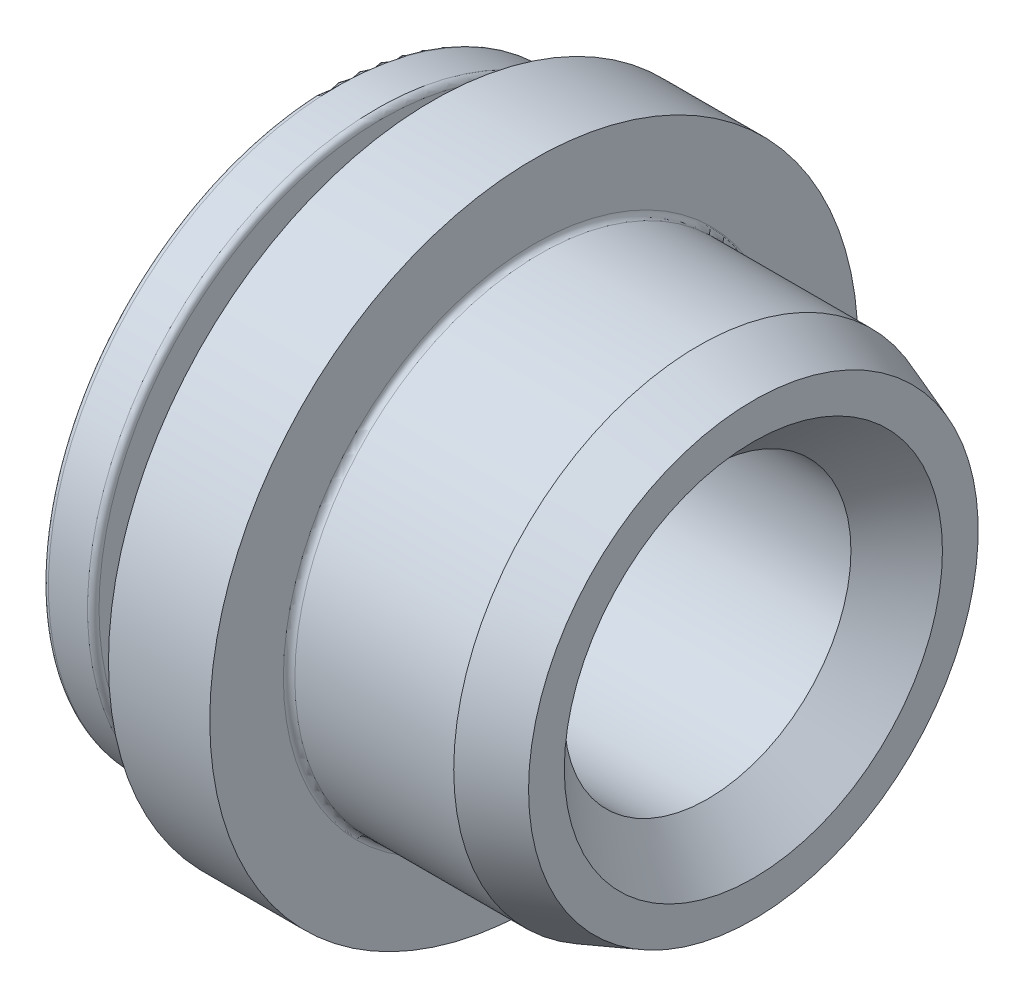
ISO-10303-21;
HEADER;
FILE_DESCRIPTION(('STEP AP214'),'2;1');
FILE_NAME('part.step','',(''),(''),'','','');
FILE_SCHEMA(('AUTOMOTIVE_DESIGN { 1 0 10303 214 1 1 1 1 }'));
ENDSEC;
DATA;
#1=APPLICATION_CONTEXT('core data for automotive mechanical design processes');
#2=APPLICATION_PROTOCOL_DEFINITION('international standard','automotive_design',2000,#1);
#3=PRODUCT_CONTEXT('',#1,'mechanical');
#4=PRODUCT('Part','Part','',(#3));
#5=PRODUCT_RELATED_PRODUCT_CATEGORY('part','',(#4));
#6=PRODUCT_DEFINITION_FORMATION('','',#4);
#7=PRODUCT_DEFINITION_CONTEXT('part definition',#1,'design');
#8=PRODUCT_DEFINITION('design','',#6,#7);
#9=PRODUCT_DEFINITION_SHAPE('','',#8);
#10=(LENGTH_UNIT() NAMED_UNIT(*) SI_UNIT(.MILLI.,.METRE.));
#11=(NAMED_UNIT(*) PLANE_ANGLE_UNIT() SI_UNIT($,.RADIAN.));
#12=(NAMED_UNIT(*) SI_UNIT($,.STERADIAN.) SOLID_ANGLE_UNIT());
#13=UNCERTAINTY_MEASURE_WITH_UNIT(LENGTH_MEASURE(1.E-05),#10,'distance_accuracy_value','');
#14=(GEOMETRIC_REPRESENTATION_CONTEXT(3) GLOBAL_UNCERTAINTY_ASSIGNED_CONTEXT((#13)) GLOBAL_UNIT_ASSIGNED_CONTEXT((#10,
#11,#12)) REPRESENTATION_CONTEXT('',''));
#15=CARTESIAN_POINT('',(0.,0.,0.));
#16=DIRECTION('',(0.,0.,1.));
#17=DIRECTION('',(1.,0.,0.));
#18=AXIS2_PLACEMENT_3D('',#15,#16,#17);
#19=CARTESIAN_POINT('',(0.71882,0.,0.));
#20=DIRECTION('',(1.,0.,0.));
#21=DIRECTION('',(0.,0.,-1.));
#22=AXIS2_PLACEMENT_3D('',#19,#20,#21);
#23=TOROIDAL_SURFACE('',#22,1.83388,0.04318);
#24=CARTESIAN_POINT('',(0.762,0.,0.));
#25=DIRECTION('',(-1.,0.,0.));
#26=DIRECTION('',(0.,0.,1.));
#27=AXIS2_PLACEMENT_3D('',#24,#25,#26);
#28=CIRCLE('',#27,1.83388);
#29=CARTESIAN_POINT('',(0.762000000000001,0.,-1.83388));
#30=VERTEX_POINT('',#29);
#31=CARTESIAN_POINT('',(0.762,0.,1.83388));
#32=VERTEX_POINT('',#31);
#33=EDGE_CURVE('E63',#30,#32,#28,.F.);
#34=ORIENTED_EDGE('',*,*,#33,.F.);
#35=CARTESIAN_POINT('',(0.762,0.,0.));
#36=DIRECTION('',(-1.,0.,0.));
#37=DIRECTION('',(0.,0.,-1.));
#38=AXIS2_PLACEMENT_3D('',#35,#36,#37);
#39=CIRCLE('',#38,1.83388);
#40=EDGE_CURVE('E66',#32,#30,#39,.F.);
#41=ORIENTED_EDGE('',*,*,#40,.F.);
#42=EDGE_LOOP('',(#34,#41));
#43=FACE_BOUND('',#42,.T.);
#44=CARTESIAN_POINT('',(0.71882,0.,0.));
#45=DIRECTION('',(1.,0.,0.));
#46=DIRECTION('',(0.,0.,-1.));
#47=AXIS2_PLACEMENT_3D('',#44,#45,#46);
#48=CIRCLE('',#47,1.7907);
#49=CARTESIAN_POINT('',(0.718820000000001,0.,-1.7907));
#50=VERTEX_POINT('',#49);
#51=EDGE_CURVE('E71',#50,#50,#48,.F.);
#52=ORIENTED_EDGE('',*,*,#51,.F.);
#53=EDGE_LOOP('',(#52));
#54=FACE_BOUND('',#53,.T.);
#55=ADVANCED_FACE('F16',(#43,#54),#23,.F.);
#56=CARTESIAN_POINT('',(0.5715,0.,0.));
#57=DIRECTION('',(1.,0.,0.));
#58=DIRECTION('',(0.,0.,-1.));
#59=AXIS2_PLACEMENT_3D('',#56,#57,#58);
#60=CYLINDRICAL_SURFACE('',#59,1.7907);
#61=ORIENTED_EDGE('',*,*,#51,.T.);
#62=EDGE_LOOP('',(#61));
#63=FACE_BOUND('',#62,.T.);
#64=CARTESIAN_POINT('',(0.42418,0.,0.));
#65=DIRECTION('',(1.,0.,0.));
#66=DIRECTION('',(0.,0.,-1.));
#67=AXIS2_PLACEMENT_3D('',#64,#65,#66);
#68=CIRCLE('',#67,1.7907);
#69=CARTESIAN_POINT('',(0.42418,0.,-1.7907));
#70=VERTEX_POINT('',#69);
#71=EDGE_CURVE('E76',#70,#70,#68,.T.);
#72=ORIENTED_EDGE('',*,*,#71,.T.);
#73=EDGE_LOOP('',(#72));
#74=FACE_BOUND('',#73,.T.);
#75=ADVANCED_FACE('F411',(#63,#74),#60,.T.);
#76=CARTESIAN_POINT('',(0.762,0.,2.00279));
#77=DIRECTION('',(-1.,0.,0.));
#78=DIRECTION('',(0.,0.,1.));
#79=AXIS2_PLACEMENT_3D('',#76,#77,#78);
#80=PLANE('',#79);
#81=ORIENTED_EDGE('',*,*,#40,.T.);
#82=ORIENTED_EDGE('',*,*,#33,.T.);
#83=EDGE_LOOP('',(#81,#82));
#84=FACE_BOUND('',#83,.T.);
#85=CARTESIAN_POINT('',(0.762,0.,0.));
#86=DIRECTION('',(-1.,0.,0.));
#87=DIRECTION('',(0.,0.,1.));
#88=AXIS2_PLACEMENT_3D('',#85,#86,#87);
#89=CIRCLE('',#88,2.4384);
#90=CARTESIAN_POINT('',(0.761999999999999,0.,2.4384));
#91=VERTEX_POINT('',#90);
#92=EDGE_CURVE('E105',#91,#91,#89,.F.);
#93=ORIENTED_EDGE('',*,*,#92,.F.);
#94=EDGE_LOOP('',(#93));
#95=FACE_BOUND('',#94,.T.);
#96=ADVANCED_FACE('F68',(#84,#95),#80,.T.);
#97=CARTESIAN_POINT('',(0.42418,0.,0.));
#98=DIRECTION('',(1.,0.,0.));
#99=DIRECTION('',(0.,0.,-1.));
#100=AXIS2_PLACEMENT_3D('',#97,#98,#99);
#101=TOROIDAL_SURFACE('',#100,1.83388,0.0431799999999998);
#102=ORIENTED_EDGE('',*,*,#71,.F.);
#103=EDGE_LOOP('',(#102));
#104=FACE_BOUND('',#103,.T.);
#105=CARTESIAN_POINT('',(0.381,0.,0.));
#106=DIRECTION('',(1.,0.,0.));
#107=DIRECTION('',(0.,0.,1.));
#108=AXIS2_PLACEMENT_3D('',#105,#106,#107);
#109=CIRCLE('',#108,1.83388);
#110=CARTESIAN_POINT('',(0.381000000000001,0.,-1.83388));
#111=VERTEX_POINT('',#110);
#112=CARTESIAN_POINT('',(0.381,0.,1.83388));
#113=VERTEX_POINT('',#112);
#114=EDGE_CURVE('E108',#111,#113,#109,.F.);
#115=ORIENTED_EDGE('',*,*,#114,.F.);
#116=CARTESIAN_POINT('',(0.381,0.,0.));
#117=DIRECTION('',(1.,0.,0.));
#118=DIRECTION('',(0.,0.,-1.));
#119=AXIS2_PLACEMENT_3D('',#116,#117,#118);
#120=CIRCLE('',#119,1.83388);
#121=EDGE_CURVE('E104',#113,#111,#120,.F.);
#122=ORIENTED_EDGE('',*,*,#121,.F.);
#123=EDGE_LOOP('',(#115,#122));
#124=FACE_BOUND('',#123,.T.);
#125=ADVANCED_FACE('F201',(#104,#124),#101,.F.);
#126=CARTESIAN_POINT('',(1.143,0.,0.));
#127=DIRECTION('',(-1.,0.,0.));
#128=DIRECTION('',(0.,0.,1.));
#129=AXIS2_PLACEMENT_3D('',#126,#127,#128);
#130=CYLINDRICAL_SURFACE('',#129,2.4384);
#131=CARTESIAN_POINT('',(1.524,0.,0.));
#132=DIRECTION('',(-1.,0.,0.));
#133=DIRECTION('',(0.,0.,1.));
#134=AXIS2_PLACEMENT_3D('',#131,#132,#133);
#135=CIRCLE('',#134,2.4384);
#136=CARTESIAN_POINT('',(1.524,0.,2.4384));
#137=VERTEX_POINT('',#136);
#138=EDGE_CURVE('E100',#137,#137,#135,.F.);
#139=ORIENTED_EDGE('',*,*,#138,.F.);
#140=EDGE_LOOP('',(#139));
#141=FACE_BOUND('',#140,.T.);
#142=ORIENTED_EDGE('',*,*,#92,.T.);
#143=EDGE_LOOP('',(#142));
#144=FACE_BOUND('',#143,.T.);
#145=ADVANCED_FACE('F212',(#141,#144),#130,.T.);
#146=CARTESIAN_POINT('',(0.381,0.,1.9812));
#147=DIRECTION('',(1.,0.,0.));
#148=DIRECTION('',(0.,0.,-1.));
#149=AXIS2_PLACEMENT_3D('',#146,#147,#148);
#150=PLANE('',#149);
#151=CARTESIAN_POINT('',(0.381,0.,0.));
#152=DIRECTION('',(-1.,0.,0.));
#153=DIRECTION('',(0.,0.,-1.));
#154=AXIS2_PLACEMENT_3D('',#151,#152,#153);
#155=CIRCLE('',#154,2.12852);
#156=CARTESIAN_POINT('',(0.381000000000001,0.,-2.12852));
#157=VERTEX_POINT('',#156);
#158=CARTESIAN_POINT('',(0.381,0.,2.12852));
#159=VERTEX_POINT('',#158);
#160=EDGE_CURVE('E103',#157,#159,#155,.T.);
#161=ORIENTED_EDGE('',*,*,#160,.F.);
#162=CARTESIAN_POINT('',(0.381,0.,0.));
#163=DIRECTION('',(-1.,0.,0.));
#164=DIRECTION('',(0.,0.,1.));
#165=AXIS2_PLACEMENT_3D('',#162,#163,#164);
#166=CIRCLE('',#165,2.12852);
#167=EDGE_CURVE('E263',#159,#157,#166,.T.);
#168=ORIENTED_EDGE('',*,*,#167,.F.);
#169=EDGE_LOOP('',(#161,#168));
#170=FACE_BOUND('',#169,.T.);
#171=ORIENTED_EDGE('',*,*,#114,.T.);
#172=ORIENTED_EDGE('',*,*,#121,.T.);
#173=EDGE_LOOP('',(#171,#172));
#174=FACE_BOUND('',#173,.T.);
#175=ADVANCED_FACE('F232',(#170,#174),#150,.T.);
#176=CARTESIAN_POINT('',(1.524,0.,1.08585));
#177=DIRECTION('',(1.,0.,0.));
#178=DIRECTION('',(0.,0.,-1.));
#179=AXIS2_PLACEMENT_3D('',#176,#177,#178);
#180=PLANE('',#179);
#181=CARTESIAN_POINT('',(1.524,0.,0.));
#182=DIRECTION('',(1.,0.,0.));
#183=DIRECTION('',(0.,0.,1.));
#184=AXIS2_PLACEMENT_3D('',#181,#182,#183);
#185=CIRCLE('',#184,1.88468);
#186=CARTESIAN_POINT('',(1.524,0.,-1.88468));
#187=VERTEX_POINT('',#186);
#188=CARTESIAN_POINT('',(1.524,0.,1.88468));
#189=VERTEX_POINT('',#188);
#190=EDGE_CURVE('E271',#187,#189,#185,.F.);
#191=ORIENTED_EDGE('',*,*,#190,.T.);
#192=CARTESIAN_POINT('',(1.524,0.,0.));
#193=DIRECTION('',(1.,0.,0.));
#194=DIRECTION('',(0.,0.,-1.));
#195=AXIS2_PLACEMENT_3D('',#192,#193,#194);
#196=CIRCLE('',#195,1.88468);
#197=EDGE_CURVE('E273',#189,#187,#196,.F.);
#198=ORIENTED_EDGE('',*,*,#197,.T.);
#199=EDGE_LOOP('',(#191,#198));
#200=FACE_BOUND('',#199,.T.);
#201=ORIENTED_EDGE('',*,*,#138,.T.);
#202=EDGE_LOOP('',(#201));
#203=FACE_BOUND('',#202,.T.);
#204=ADVANCED_FACE('F244',(#200,#203),#180,.T.);
#205=CARTESIAN_POINT('',(0.337820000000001,0.,0.));
#206=DIRECTION('',(1.,0.,0.));
#207=DIRECTION('',(0.,0.,-1.));
#208=AXIS2_PLACEMENT_3D('',#205,#206,#207);
#209=TOROIDAL_SURFACE('',#208,2.12852,0.0431799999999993);
#210=CARTESIAN_POINT('',(0.33782,0.,0.));
#211=DIRECTION('',(1.,0.,0.));
#212=DIRECTION('',(0.,0.,-1.));
#213=AXIS2_PLACEMENT_3D('',#210,#211,#212);
#214=CIRCLE('',#213,2.1717);
#215=CARTESIAN_POINT('',(0.337820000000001,0.,-2.1717));
#216=VERTEX_POINT('',#215);
#217=EDGE_CURVE('E277',#216,#216,#214,.F.);
#218=ORIENTED_EDGE('',*,*,#217,.F.);
#219=EDGE_LOOP('',(#218));
#220=FACE_BOUND('',#219,.T.);
#221=ORIENTED_EDGE('',*,*,#167,.T.);
#222=ORIENTED_EDGE('',*,*,#160,.T.);
#223=EDGE_LOOP('',(#221,#222));
#224=FACE_BOUND('',#223,.T.);
#225=ADVANCED_FACE('F163',(#220,#224),#209,.T.);
#226=CARTESIAN_POINT('',(1.56718,0.,0.));
#227=DIRECTION('',(1.,0.,0.));
#228=DIRECTION('',(0.,0.,-1.));
#229=AXIS2_PLACEMENT_3D('',#226,#227,#228);
#230=TOROIDAL_SURFACE('',#229,1.88468,0.0431800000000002);
#231=CARTESIAN_POINT('',(1.56718,0.,0.));
#232=DIRECTION('',(1.,0.,0.));
#233=DIRECTION('',(0.,0.,-1.));
#234=AXIS2_PLACEMENT_3D('',#231,#232,#233);
#235=CIRCLE('',#234,1.8415);
#236=CARTESIAN_POINT('',(1.56718,0.,-1.8415));
#237=VERTEX_POINT('',#236);
#238=EDGE_CURVE('E153',#237,#237,#235,.T.);
#239=ORIENTED_EDGE('',*,*,#238,.F.);
#240=EDGE_LOOP('',(#239));
#241=FACE_BOUND('',#240,.T.);
#242=ORIENTED_EDGE('',*,*,#190,.F.);
#243=ORIENTED_EDGE('',*,*,#197,.F.);
#244=EDGE_LOOP('',(#242,#243));
#245=FACE_BOUND('',#244,.T.);
#246=ADVANCED_FACE('F158',(#241,#245),#230,.F.);
#247=CARTESIAN_POINT('',(0.1905,0.,0.));
#248=DIRECTION('',(1.,0.,0.));
#249=DIRECTION('',(0.,0.,-1.));
#250=AXIS2_PLACEMENT_3D('',#247,#248,#249);
#251=CYLINDRICAL_SURFACE('',#250,2.1717);
#252=ORIENTED_EDGE('',*,*,#217,.T.);
#253=EDGE_LOOP('',(#252));
#254=FACE_BOUND('',#253,.T.);
#255=CARTESIAN_POINT('',(0.04318,0.,0.));
#256=DIRECTION('',(1.,0.,0.));
#257=DIRECTION('',(0.,0.,-1.));
#258=AXIS2_PLACEMENT_3D('',#255,#256,#257);
#259=CIRCLE('',#258,2.1717);
#260=CARTESIAN_POINT('',(0.0431800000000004,0.,-2.1717));
#261=VERTEX_POINT('',#260);
#262=EDGE_CURVE('E150',#261,#261,#259,.F.);
#263=ORIENTED_EDGE('',*,*,#262,.F.);
#264=EDGE_LOOP('',(#263));
#265=FACE_BOUND('',#264,.T.);
#266=ADVANCED_FACE('F162',(#254,#265),#251,.T.);
#267=CARTESIAN_POINT('',(2.164715,0.,0.));
#268=DIRECTION('',(1.,0.,0.));
#269=DIRECTION('',(0.,0.,-1.));
#270=AXIS2_PLACEMENT_3D('',#267,#268,#269);
#271=CYLINDRICAL_SURFACE('',#270,1.8415);
#272=CARTESIAN_POINT('',(2.76224999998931,0.,0.));
#273=DIRECTION('',(-1.,0.,0.));
#274=DIRECTION('',(0.,0.,1.));
#275=AXIS2_PLACEMENT_3D('',#272,#273,#274);
#276=CIRCLE('',#275,1.84150000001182);
#277=CARTESIAN_POINT('',(2.76224999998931,0.,1.84150000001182));
#278=VERTEX_POINT('',#277);
#279=EDGE_CURVE('E142',#278,#278,#276,.F.);
#280=ORIENTED_EDGE('',*,*,#279,.F.);
#281=EDGE_LOOP('',(#280));
#282=FACE_BOUND('',#281,.T.);
#283=ORIENTED_EDGE('',*,*,#238,.T.);
#284=EDGE_LOOP('',(#283));
#285=FACE_BOUND('',#284,.T.);
#286=ADVANCED_FACE('F128',(#282,#285),#271,.T.);
#287=CARTESIAN_POINT('',(0.04318,0.,0.));
#288=DIRECTION('',(1.,0.,0.));
#289=DIRECTION('',(0.,0.,-1.));
#290=AXIS2_PLACEMENT_3D('',#287,#288,#289);
#291=TOROIDAL_SURFACE('',#290,2.12852,0.0431800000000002);
#292=CARTESIAN_POINT('',(0.,0.,0.));
#293=DIRECTION('',(1.,0.,0.));
#294=DIRECTION('',(0.,0.,1.));
#295=AXIS2_PLACEMENT_3D('',#292,#293,#294);
#296=CIRCLE('',#295,2.12852);
#297=CARTESIAN_POINT('',(0.,0.,-2.12852));
#298=VERTEX_POINT('',#297);
#299=CARTESIAN_POINT('',(0.,0.,2.12852));
#300=VERTEX_POINT('',#299);
#301=EDGE_CURVE('E36',#298,#300,#296,.F.);
#302=ORIENTED_EDGE('',*,*,#301,.F.);
#303=CARTESIAN_POINT('',(0.,0.,0.));
#304=DIRECTION('',(1.,0.,0.));
#305=DIRECTION('',(0.,0.,-1.));
#306=AXIS2_PLACEMENT_3D('',#303,#304,#305);
#307=CIRCLE('',#306,2.12852);
#308=EDGE_CURVE('E99',#300,#298,#307,.F.);
#309=ORIENTED_EDGE('',*,*,#308,.F.);
#310=EDGE_LOOP('',(#302,#309));
#311=FACE_BOUND('',#310,.T.);
#312=ORIENTED_EDGE('',*,*,#262,.T.);
#313=EDGE_LOOP('',(#312));
#314=FACE_BOUND('',#313,.T.);
#315=ADVANCED_FACE('F116',(#311,#314),#291,.T.);
#316=CARTESIAN_POINT('',(2.76225000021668,0.,0.));
#317=DIRECTION('',(-1.,0.,0.));
#318=DIRECTION('',(0.,0.,1.));
#319=AXIS2_PLACEMENT_3D('',#316,#317,#318);
#320=CONICAL_SURFACE('',#319,1.84149999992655,0.349065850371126);
#321=CARTESIAN_POINT('',(3.17500000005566,0.,0.));
#322=DIRECTION('',(-1.,0.,0.));
#323=DIRECTION('',(0.,0.,1.));
#324=AXIS2_PLACEMENT_3D('',#321,#322,#323);
#325=CIRCLE('',#324,1.69127128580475);
#326=CARTESIAN_POINT('',(3.17500000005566,0.,1.69127128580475));
#327=VERTEX_POINT('',#326);
#328=EDGE_CURVE('E96',#327,#327,#325,.F.);
#329=ORIENTED_EDGE('',*,*,#328,.F.);
#330=EDGE_LOOP('',(#329));
#331=FACE_BOUND('',#330,.T.);
#332=ORIENTED_EDGE('',*,*,#279,.T.);
#333=EDGE_LOOP('',(#332));
#334=FACE_BOUND('',#333,.T.);
#335=ADVANCED_FACE('F127',(#331,#334),#320,.T.);
#336=CARTESIAN_POINT('',(0.,0.,1.06426));
#337=DIRECTION('',(-1.,0.,0.));
#338=DIRECTION('',(0.,0.,1.));
#339=AXIS2_PLACEMENT_3D('',#336,#337,#338);
#340=PLANE('',#339);
#341=ORIENTED_EDGE('',*,*,#301,.T.);
#342=ORIENTED_EDGE('',*,*,#308,.T.);
#343=EDGE_LOOP('',(#341,#342));
#344=FACE_BOUND('',#343,.T.);
#345=CARTESIAN_POINT('',(-1.13686750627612E-10,0.,0.));
#346=DIRECTION('',(-1.,0.,0.));
#347=DIRECTION('',(0.,-1.,0.));
#348=AXIS2_PLACEMENT_3D('',#345,#346,#347);
#349=CIRCLE('',#348,1.42240000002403);
#350=CARTESIAN_POINT('',(-1.13686576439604E-10,-1.42240000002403,0.));
#351=VERTEX_POINT('',#350);
#352=EDGE_CURVE('E93',#351,#351,#349,.F.);
#353=ORIENTED_EDGE('',*,*,#352,.T.);
#354=EDGE_LOOP('',(#353));
#355=FACE_BOUND('',#354,.T.);
#356=ADVANCED_FACE('F329',(#344,#355),#340,.T.);
#357=CARTESIAN_POINT('',(3.175,0.,0.845635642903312));
#358=DIRECTION('',(1.,0.,0.));
#359=DIRECTION('',(0.,0.,-1.));
#360=AXIS2_PLACEMENT_3D('',#357,#358,#359);
#361=PLANE('',#360);
#362=ORIENTED_EDGE('',*,*,#328,.T.);
#363=EDGE_LOOP('',(#362));
#364=FACE_BOUND('',#363,.T.);
#365=CARTESIAN_POINT('',(3.1750000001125,0.,0.));
#366=DIRECTION('',(1.,0.,0.));
#367=DIRECTION('',(0.,0.,-1.));
#368=AXIS2_PLACEMENT_3D('',#365,#366,#367);
#369=CIRCLE('',#368,1.42240000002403);
#370=CARTESIAN_POINT('',(3.1750000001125,0.,-1.42240000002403));
#371=VERTEX_POINT('',#370);
#372=EDGE_CURVE('E90',#371,#371,#369,.F.);
#373=ORIENTED_EDGE('',*,*,#372,.T.);
#374=EDGE_LOOP('',(#373));
#375=FACE_BOUND('',#374,.T.);
#376=ADVANCED_FACE('F326',(#364,#375),#361,.T.);
#377=CARTESIAN_POINT('',(-5.68433317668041E-11,0.,0.));
#378=DIRECTION('',(-1.,0.,0.));
#379=DIRECTION('',(0.,-1.,0.));
#380=AXIS2_PLACEMENT_3D('',#377,#378,#379);
#381=CONICAL_SURFACE('',#380,1.42239999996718,0.785398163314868);
#382=CARTESIAN_POINT('',(0.34417,0.,0.));
#383=DIRECTION('',(-1.,0.,0.));
#384=DIRECTION('',(0.,-1.,0.));
#385=AXIS2_PLACEMENT_3D('',#382,#383,#384);
#386=CIRCLE('',#385,1.07823);
#387=CARTESIAN_POINT('',(0.34417,-1.07823,0.));
#388=VERTEX_POINT('',#387);
#389=EDGE_CURVE('E28',#388,#388,#386,.F.);
#390=ORIENTED_EDGE('',*,*,#389,.T.);
#391=EDGE_LOOP('',(#390));
#392=FACE_BOUND('',#391,.T.);
#393=ORIENTED_EDGE('',*,*,#352,.F.);
#394=EDGE_LOOP('',(#393));
#395=FACE_BOUND('',#394,.T.);
#396=ADVANCED_FACE('F318',(#392,#395),#381,.F.);
#397=CARTESIAN_POINT('',(3.1750000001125,0.,0.));
#398=DIRECTION('',(1.,0.,0.));
#399=DIRECTION('',(0.,0.,-1.));
#400=AXIS2_PLACEMENT_3D('',#397,#398,#399);
#401=CONICAL_SURFACE('',#400,1.42240000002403,0.785398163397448);
#402=ORIENTED_EDGE('',*,*,#372,.F.);
#403=EDGE_LOOP('',(#402));
#404=FACE_BOUND('',#403,.T.);
#405=CARTESIAN_POINT('',(2.83083,0.,0.));
#406=DIRECTION('',(-1.,0.,0.));
#407=DIRECTION('',(0.,-1.,0.));
#408=AXIS2_PLACEMENT_3D('',#405,#406,#407);
#409=CIRCLE('',#408,1.07823);
#410=CARTESIAN_POINT('',(2.83083,-1.07823,0.));
#411=VERTEX_POINT('',#410);
#412=EDGE_CURVE('E11',#411,#411,#409,.T.);
#413=ORIENTED_EDGE('',*,*,#412,.T.);
#414=EDGE_LOOP('',(#413));
#415=FACE_BOUND('',#414,.T.);
#416=ADVANCED_FACE('F312',(#404,#415),#401,.F.);
#417=CARTESIAN_POINT('',(1.5875,0.,0.));
#418=DIRECTION('',(-1.,0.,0.));
#419=DIRECTION('',(0.,-1.,0.));
#420=AXIS2_PLACEMENT_3D('',#417,#418,#419);
#421=CYLINDRICAL_SURFACE('',#420,1.07823);
#422=ORIENTED_EDGE('',*,*,#412,.F.);
#423=EDGE_LOOP('',(#422));
#424=FACE_BOUND('',#423,.T.);
#425=ORIENTED_EDGE('',*,*,#389,.F.);
#426=EDGE_LOOP('',(#425));
#427=FACE_BOUND('',#426,.T.);
#428=ADVANCED_FACE('F310',(#424,#427),#421,.F.);
#429=CLOSED_SHELL('',(#55,#75,#96,#125,#145,#175,#204,#225,#246,#266,#286,#315,#335,#356,#376,
#396,#416,#428));
#430=MANIFOLD_SOLID_BREP('B1',#429);
#431=ADVANCED_BREP_SHAPE_REPRESENTATION('',(#18,#430),#14);
#432=SHAPE_DEFINITION_REPRESENTATION(#9,#431);
ENDSEC;
END-ISO-10303-21;
